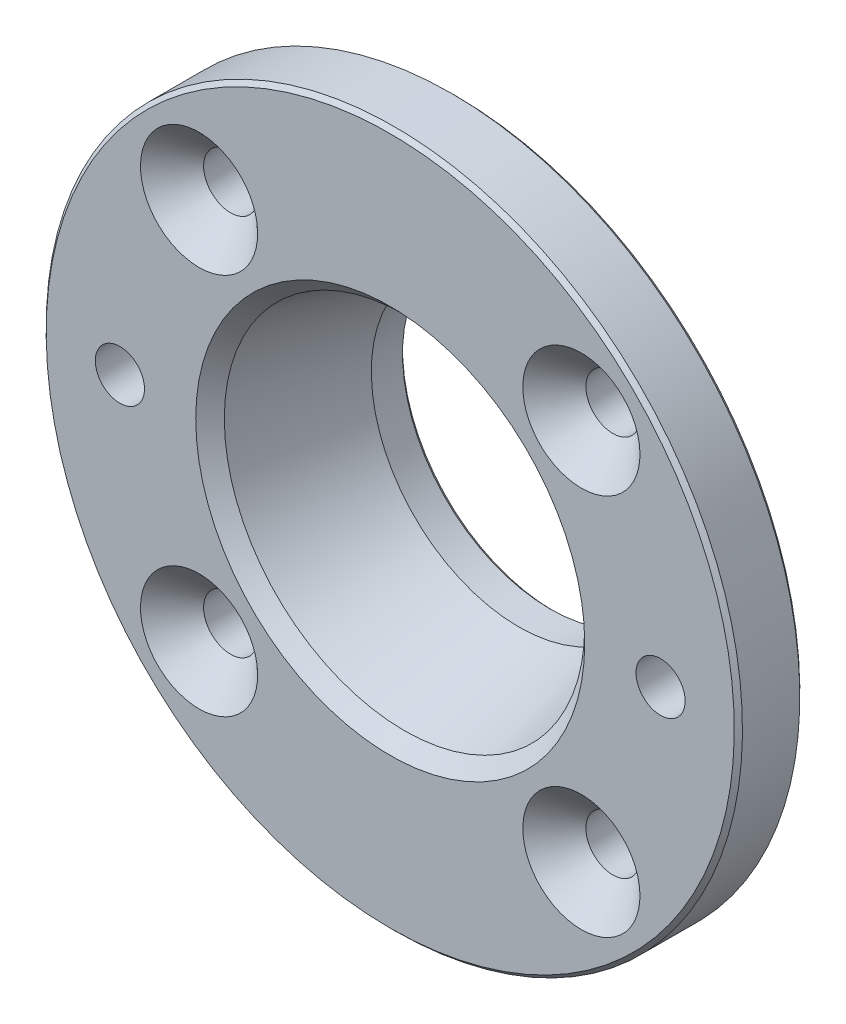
ISO-10303-21;
HEADER;
FILE_DESCRIPTION(('STEP AP214'),'2;1');
FILE_NAME('part.step','',(''),(''),'','','');
FILE_SCHEMA(('AUTOMOTIVE_DESIGN { 1 0 10303 214 1 1 1 1 }'));
ENDSEC;
DATA;
#1=APPLICATION_CONTEXT('core data for automotive mechanical design processes');
#2=APPLICATION_PROTOCOL_DEFINITION('international standard','automotive_design',2000,#1);
#3=PRODUCT_CONTEXT('',#1,'mechanical');
#4=PRODUCT('Part','Part','',(#3));
#5=PRODUCT_RELATED_PRODUCT_CATEGORY('part','',(#4));
#6=PRODUCT_DEFINITION_FORMATION('','',#4);
#7=PRODUCT_DEFINITION_CONTEXT('part definition',#1,'design');
#8=PRODUCT_DEFINITION('design','',#6,#7);
#9=PRODUCT_DEFINITION_SHAPE('','',#8);
#10=(LENGTH_UNIT() NAMED_UNIT(*) SI_UNIT(.MILLI.,.METRE.));
#11=(NAMED_UNIT(*) PLANE_ANGLE_UNIT() SI_UNIT($,.RADIAN.));
#12=(NAMED_UNIT(*) SI_UNIT($,.STERADIAN.) SOLID_ANGLE_UNIT());
#13=UNCERTAINTY_MEASURE_WITH_UNIT(LENGTH_MEASURE(1.E-05),#10,'distance_accuracy_value','');
#14=(GEOMETRIC_REPRESENTATION_CONTEXT(3) GLOBAL_UNCERTAINTY_ASSIGNED_CONTEXT((#13)) GLOBAL_UNIT_ASSIGNED_CONTEXT((#10,
#11,#12)) REPRESENTATION_CONTEXT('',''));
#15=CARTESIAN_POINT('',(0.,0.,0.));
#16=DIRECTION('',(0.,0.,1.));
#17=DIRECTION('',(1.,0.,0.));
#18=AXIS2_PLACEMENT_3D('',#15,#16,#17);
#19=CARTESIAN_POINT('',(0.,0.,-15.693364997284));
#20=DIRECTION('',(0.,0.,1.));
#21=DIRECTION('',(0.,-1.,0.));
#22=AXIS2_PLACEMENT_3D('',#19,#20,#21);
#23=CONICAL_SURFACE('',#22,18.,0.279252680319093);
#24=CARTESIAN_POINT('',(0.,0.,-15.693364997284));
#25=DIRECTION('',(0.,0.,1.));
#26=DIRECTION('',(0.,-1.,0.));
#27=AXIS2_PLACEMENT_3D('',#24,#25,#26);
#28=CIRCLE('',#27,18.);
#29=CARTESIAN_POINT('',(0.,-18.0000000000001,-15.693364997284));
#30=VERTEX_POINT('',#29);
#31=EDGE_CURVE('E58',#30,#30,#28,.T.);
#32=ORIENTED_EDGE('',*,*,#31,.F.);
#33=EDGE_LOOP('',(#32));
#34=FACE_BOUND('',#33,.T.);
#35=CARTESIAN_POINT('',(0.,0.,-1.74370722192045));
#36=DIRECTION('',(0.,0.,-1.));
#37=DIRECTION('',(-1.,0.,0.));
#38=AXIS2_PLACEMENT_3D('',#35,#36,#37);
#39=CIRCLE('',#38,22.);
#40=CARTESIAN_POINT('',(-22.,0.,-1.74370722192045));
#41=VERTEX_POINT('',#40);
#42=EDGE_CURVE('E103',#41,#41,#39,.T.);
#43=ORIENTED_EDGE('',*,*,#42,.F.);
#44=EDGE_LOOP('',(#43));
#45=FACE_BOUND('',#44,.T.);
#46=ADVANCED_FACE('F14',(#34,#45),#23,.F.);
#47=CARTESIAN_POINT('',(0.,0.,0.));
#48=DIRECTION('',(0.,0.,1.));
#49=DIRECTION('',(0.,-1.,0.));
#50=AXIS2_PLACEMENT_3D('',#47,#48,#49);
#51=CYLINDRICAL_SURFACE('',#50,18.);
#52=CARTESIAN_POINT('',(0.,0.,-19.5));
#53=DIRECTION('',(0.,0.,-1.));
#54=DIRECTION('',(0.,1.,0.));
#55=AXIS2_PLACEMENT_3D('',#52,#53,#54);
#56=CIRCLE('',#55,18.);
#57=CARTESIAN_POINT('',(0.,17.9999999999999,-19.5000000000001));
#58=VERTEX_POINT('',#57);
#59=EDGE_CURVE('E34',#58,#58,#56,.T.);
#60=ORIENTED_EDGE('',*,*,#59,.T.);
#61=EDGE_LOOP('',(#60));
#62=FACE_BOUND('',#61,.T.);
#63=ORIENTED_EDGE('',*,*,#31,.T.);
#64=EDGE_LOOP('',(#63));
#65=FACE_BOUND('',#64,.T.);
#66=ADVANCED_FACE('F159',(#62,#65),#51,.F.);
#67=CARTESIAN_POINT('',(18.,0.,-20.));
#68=DIRECTION('',(0.,0.,-1.));
#69=DIRECTION('',(0.,1.,0.));
#70=AXIS2_PLACEMENT_3D('',#67,#68,#69);
#71=PLANE('',#70);
#72=CARTESIAN_POINT('',(0.,0.,-20.));
#73=DIRECTION('',(0.,0.,-1.));
#74=DIRECTION('',(0.,1.,0.));
#75=AXIS2_PLACEMENT_3D('',#72,#73,#74);
#76=CIRCLE('',#75,18.5);
#77=CARTESIAN_POINT('',(0.,18.4999999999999,-20.0000000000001));
#78=VERTEX_POINT('',#77);
#79=EDGE_CURVE('E37',#78,#78,#76,.F.);
#80=ORIENTED_EDGE('',*,*,#79,.T.);
#81=EDGE_LOOP('',(#80));
#82=FACE_BOUND('',#81,.T.);
#83=CARTESIAN_POINT('',(0.,0.,-20.));
#84=DIRECTION('',(0.,0.,-1.));
#85=DIRECTION('',(0.,1.,0.));
#86=AXIS2_PLACEMENT_3D('',#83,#84,#85);
#87=CIRCLE('',#86,24.4);
#88=CARTESIAN_POINT('',(0.,24.3999999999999,-20.0000000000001));
#89=VERTEX_POINT('',#88);
#90=EDGE_CURVE('E40',#89,#89,#87,.T.);
#91=ORIENTED_EDGE('',*,*,#90,.T.);
#92=EDGE_LOOP('',(#91));
#93=FACE_BOUND('',#92,.T.);
#94=ADVANCED_FACE('F165',(#82,#93),#71,.T.);
#95=CARTESIAN_POINT('',(0.,0.,0.));
#96=DIRECTION('',(0.,0.,1.));
#97=DIRECTION('',(0.,-1.,0.));
#98=AXIS2_PLACEMENT_3D('',#95,#96,#97);
#99=CYLINDRICAL_SURFACE('',#98,25.);
#100=CARTESIAN_POINT('',(0.,0.,-10.));
#101=DIRECTION('',(0.,0.,1.));
#102=DIRECTION('',(0.,-1.,0.));
#103=AXIS2_PLACEMENT_3D('',#100,#101,#102);
#104=CIRCLE('',#103,25.);
#105=CARTESIAN_POINT('',(0.,-25.,-9.99999999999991));
#106=VERTEX_POINT('',#105);
#107=EDGE_CURVE('E76',#106,#106,#104,.T.);
#108=ORIENTED_EDGE('',*,*,#107,.F.);
#109=EDGE_LOOP('',(#108));
#110=FACE_BOUND('',#109,.T.);
#111=CARTESIAN_POINT('',(0.,0.,-15.9));
#112=DIRECTION('',(0.,0.,1.));
#113=DIRECTION('',(0.,-1.,0.));
#114=AXIS2_PLACEMENT_3D('',#111,#112,#113);
#115=CIRCLE('',#114,25.);
#116=CARTESIAN_POINT('',(0.,-25.0000000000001,-15.8999999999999));
#117=VERTEX_POINT('',#116);
#118=EDGE_CURVE('E61',#117,#117,#115,.T.);
#119=ORIENTED_EDGE('',*,*,#118,.T.);
#120=EDGE_LOOP('',(#119));
#121=FACE_BOUND('',#120,.T.);
#122=ADVANCED_FACE('F173',(#110,#121),#99,.T.);
#123=CARTESIAN_POINT('',(25.,0.,-8.));
#124=DIRECTION('',(0.,0.,-1.));
#125=DIRECTION('',(0.,1.,0.));
#126=AXIS2_PLACEMENT_3D('',#123,#124,#125);
#127=PLANE('',#126);
#128=CARTESIAN_POINT('',(-33.,0.,-8.));
#129=DIRECTION('',(0.,0.,-1.));
#130=DIRECTION('',(0.,1.,0.));
#131=AXIS2_PLACEMENT_3D('',#128,#129,#130);
#132=CIRCLE('',#131,3.);
#133=CARTESIAN_POINT('',(-33.,3.,-8.00000000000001));
#134=VERTEX_POINT('',#133);
#135=EDGE_CURVE('E109',#134,#134,#132,.T.);
#136=ORIENTED_EDGE('',*,*,#135,.F.);
#137=EDGE_LOOP('',(#136));
#138=FACE_BOUND('',#137,.T.);
#139=CARTESIAN_POINT('',(33.,0.,-8.));
#140=DIRECTION('',(0.,0.,-1.));
#141=DIRECTION('',(0.,1.,0.));
#142=AXIS2_PLACEMENT_3D('',#139,#140,#141);
#143=CIRCLE('',#142,3.);
#144=CARTESIAN_POINT('',(33.,3.,-8.00000000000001));
#145=VERTEX_POINT('',#144);
#146=EDGE_CURVE('E112',#145,#145,#143,.T.);
#147=ORIENTED_EDGE('',*,*,#146,.F.);
#148=EDGE_LOOP('',(#147));
#149=FACE_BOUND('',#148,.T.);
#150=CARTESIAN_POINT('',(-23.3345237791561,23.334523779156,-8.));
#151=DIRECTION('',(0.,0.,-1.));
#152=DIRECTION('',(0.,1.,0.));
#153=AXIS2_PLACEMENT_3D('',#150,#151,#152);
#154=CIRCLE('',#153,3.3);
#155=CARTESIAN_POINT('',(-23.3345237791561,26.634523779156,-8.00000000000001));
#156=VERTEX_POINT('',#155);
#157=EDGE_CURVE('E9',#156,#156,#154,.T.);
#158=ORIENTED_EDGE('',*,*,#157,.F.);
#159=EDGE_LOOP('',(#158));
#160=FACE_BOUND('',#159,.T.);
#161=CARTESIAN_POINT('',(23.334523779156,23.334523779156,-8.));
#162=DIRECTION('',(0.,0.,-1.));
#163=DIRECTION('',(0.,1.,0.));
#164=AXIS2_PLACEMENT_3D('',#161,#162,#163);
#165=CIRCLE('',#164,3.3);
#166=CARTESIAN_POINT('',(23.334523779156,26.634523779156,-8.00000000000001));
#167=VERTEX_POINT('',#166);
#168=EDGE_CURVE('E22',#167,#167,#165,.T.);
#169=ORIENTED_EDGE('',*,*,#168,.F.);
#170=EDGE_LOOP('',(#169));
#171=FACE_BOUND('',#170,.T.);
#172=CARTESIAN_POINT('',(23.3345237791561,-23.3345237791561,-8.));
#173=DIRECTION('',(0.,0.,-1.));
#174=DIRECTION('',(0.,1.,0.));
#175=AXIS2_PLACEMENT_3D('',#172,#173,#174);
#176=CIRCLE('',#175,3.3);
#177=CARTESIAN_POINT('',(23.3345237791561,-20.0345237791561,-8.00000000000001));
#178=VERTEX_POINT('',#177);
#179=EDGE_CURVE('E26',#178,#178,#176,.T.);
#180=ORIENTED_EDGE('',*,*,#179,.F.);
#181=EDGE_LOOP('',(#180));
#182=FACE_BOUND('',#181,.T.);
#183=CARTESIAN_POINT('',(-23.334523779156,-23.3345237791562,-8.));
#184=DIRECTION('',(0.,0.,-1.));
#185=DIRECTION('',(0.,1.,0.));
#186=AXIS2_PLACEMENT_3D('',#183,#184,#185);
#187=CIRCLE('',#186,3.3);
#188=CARTESIAN_POINT('',(-23.334523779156,-20.0345237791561,-8.00000000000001));
#189=VERTEX_POINT('',#188);
#190=EDGE_CURVE('E31',#189,#189,#187,.T.);
#191=ORIENTED_EDGE('',*,*,#190,.F.);
#192=EDGE_LOOP('',(#191));
#193=FACE_BOUND('',#192,.T.);
#194=CARTESIAN_POINT('',(0.,0.,-8.));
#195=DIRECTION('',(0.,0.,1.));
#196=DIRECTION('',(0.,-1.,0.));
#197=AXIS2_PLACEMENT_3D('',#194,#195,#196);
#198=CIRCLE('',#197,26.);
#199=CARTESIAN_POINT('',(0.,-26.,-7.99999999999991));
#200=VERTEX_POINT('',#199);
#201=EDGE_CURVE('E67',#200,#200,#198,.T.);
#202=ORIENTED_EDGE('',*,*,#201,.T.);
#203=EDGE_LOOP('',(#202));
#204=FACE_BOUND('',#203,.T.);
#205=CARTESIAN_POINT('',(0.,0.,-8.));
#206=DIRECTION('',(0.,0.,-1.));
#207=DIRECTION('',(0.,1.,0.));
#208=AXIS2_PLACEMENT_3D('',#205,#206,#207);
#209=CIRCLE('',#208,42.);
#210=CARTESIAN_POINT('',(0.,42.,-8.00000000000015));
#211=VERTEX_POINT('',#210);
#212=EDGE_CURVE('E46',#211,#211,#209,.T.);
#213=ORIENTED_EDGE('',*,*,#212,.T.);
#214=EDGE_LOOP('',(#213));
#215=FACE_BOUND('',#214,.T.);
#216=ADVANCED_FACE('F177',(#138,#149,#160,#171,#182,#193,#204,#215),#127,.T.);
#217=CARTESIAN_POINT('',(0.,0.,0.));
#218=DIRECTION('',(0.,0.,1.));
#219=DIRECTION('',(0.,-1.,0.));
#220=AXIS2_PLACEMENT_3D('',#217,#218,#219);
#221=CYLINDRICAL_SURFACE('',#220,42.5);
#222=CARTESIAN_POINT('',(0.,0.,-0.5));
#223=DIRECTION('',(0.,0.,1.));
#224=DIRECTION('',(0.,-1.,0.));
#225=AXIS2_PLACEMENT_3D('',#222,#223,#224);
#226=CIRCLE('',#225,42.5);
#227=CARTESIAN_POINT('',(0.,-42.5,-0.499999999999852));
#228=VERTEX_POINT('',#227);
#229=EDGE_CURVE('E49',#228,#228,#226,.F.);
#230=ORIENTED_EDGE('',*,*,#229,.T.);
#231=EDGE_LOOP('',(#230));
#232=FACE_BOUND('',#231,.T.);
#233=CARTESIAN_POINT('',(0.,0.,-7.5));
#234=DIRECTION('',(0.,0.,-1.));
#235=DIRECTION('',(0.,1.,0.));
#236=AXIS2_PLACEMENT_3D('',#233,#234,#235);
#237=CIRCLE('',#236,42.5);
#238=CARTESIAN_POINT('',(0.,42.5,-7.50000000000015));
#239=VERTEX_POINT('',#238);
#240=EDGE_CURVE('E52',#239,#239,#237,.F.);
#241=ORIENTED_EDGE('',*,*,#240,.T.);
#242=EDGE_LOOP('',(#241));
#243=FACE_BOUND('',#242,.T.);
#244=ADVANCED_FACE('F128',(#232,#243),#221,.T.);
#245=CARTESIAN_POINT('',(22.5,0.,0.));
#246=DIRECTION('',(0.,0.,1.));
#247=DIRECTION('',(0.,-1.,0.));
#248=AXIS2_PLACEMENT_3D('',#245,#246,#247);
#249=PLANE('',#248);
#250=CARTESIAN_POINT('',(-33.,0.,0.));
#251=DIRECTION('',(0.,0.,1.));
#252=DIRECTION('',(1.,0.,0.));
#253=AXIS2_PLACEMENT_3D('',#250,#251,#252);
#254=CIRCLE('',#253,3.);
#255=CARTESIAN_POINT('',(-30.,0.,0.));
#256=VERTEX_POINT('',#255);
#257=EDGE_CURVE('E115',#256,#256,#254,.T.);
#258=ORIENTED_EDGE('',*,*,#257,.F.);
#259=EDGE_LOOP('',(#258));
#260=FACE_BOUND('',#259,.T.);
#261=CARTESIAN_POINT('',(33.,0.,0.));
#262=DIRECTION('',(0.,0.,1.));
#263=DIRECTION('',(1.,0.,0.));
#264=AXIS2_PLACEMENT_3D('',#261,#262,#263);
#265=CIRCLE('',#264,3.);
#266=CARTESIAN_POINT('',(36.,0.,0.));
#267=VERTEX_POINT('',#266);
#268=EDGE_CURVE('E116',#267,#267,#265,.T.);
#269=ORIENTED_EDGE('',*,*,#268,.F.);
#270=EDGE_LOOP('',(#269));
#271=FACE_BOUND('',#270,.T.);
#272=CARTESIAN_POINT('',(0.,0.,0.));
#273=DIRECTION('',(0.,0.,-1.));
#274=DIRECTION('',(-1.,0.,0.));
#275=AXIS2_PLACEMENT_3D('',#272,#273,#274);
#276=CIRCLE('',#275,23.7437072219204);
#277=CARTESIAN_POINT('',(-23.7437072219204,0.,0.));
#278=VERTEX_POINT('',#277);
#279=EDGE_CURVE('E106',#278,#278,#276,.T.);
#280=ORIENTED_EDGE('',*,*,#279,.T.);
#281=EDGE_LOOP('',(#280));
#282=FACE_BOUND('',#281,.T.);
#283=CARTESIAN_POINT('',(23.334523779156,23.3345237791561,0.));
#284=DIRECTION('',(0.,0.,1.));
#285=DIRECTION('',(0.,-1.,0.));
#286=AXIS2_PLACEMENT_3D('',#283,#284,#285);
#287=CIRCLE('',#286,7.15);
#288=CARTESIAN_POINT('',(23.334523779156,16.1845237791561,0.));
#289=VERTEX_POINT('',#288);
#290=EDGE_CURVE('E100',#289,#289,#287,.T.);
#291=ORIENTED_EDGE('',*,*,#290,.F.);
#292=EDGE_LOOP('',(#291));
#293=FACE_BOUND('',#292,.T.);
#294=CARTESIAN_POINT('',(23.3345237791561,-23.334523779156,0.));
#295=DIRECTION('',(0.,0.,1.));
#296=DIRECTION('',(0.,-1.,0.));
#297=AXIS2_PLACEMENT_3D('',#294,#295,#296);
#298=CIRCLE('',#297,7.15);
#299=CARTESIAN_POINT('',(23.3345237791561,-30.484523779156,1.06436145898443E-13));
#300=VERTEX_POINT('',#299);
#301=EDGE_CURVE('E94',#300,#300,#298,.T.);
#302=ORIENTED_EDGE('',*,*,#301,.F.);
#303=EDGE_LOOP('',(#302));
#304=FACE_BOUND('',#303,.T.);
#305=CARTESIAN_POINT('',(-23.334523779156,-23.3345237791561,0.));
#306=DIRECTION('',(0.,0.,1.));
#307=DIRECTION('',(0.,-1.,0.));
#308=AXIS2_PLACEMENT_3D('',#305,#306,#307);
#309=CIRCLE('',#308,7.15);
#310=CARTESIAN_POINT('',(-23.334523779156,-30.4845237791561,1.06436145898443E-13));
#311=VERTEX_POINT('',#310);
#312=EDGE_CURVE('E88',#311,#311,#309,.T.);
#313=ORIENTED_EDGE('',*,*,#312,.F.);
#314=EDGE_LOOP('',(#313));
#315=FACE_BOUND('',#314,.T.);
#316=CARTESIAN_POINT('',(-23.3345237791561,23.334523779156,0.));
#317=DIRECTION('',(0.,0.,1.));
#318=DIRECTION('',(0.,-1.,0.));
#319=AXIS2_PLACEMENT_3D('',#316,#317,#318);
#320=CIRCLE('',#319,7.15);
#321=CARTESIAN_POINT('',(-23.3345237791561,16.184523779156,0.));
#322=VERTEX_POINT('',#321);
#323=EDGE_CURVE('E82',#322,#322,#320,.T.);
#324=ORIENTED_EDGE('',*,*,#323,.F.);
#325=EDGE_LOOP('',(#324));
#326=FACE_BOUND('',#325,.T.);
#327=CARTESIAN_POINT('',(0.,0.,0.));
#328=DIRECTION('',(0.,0.,1.));
#329=DIRECTION('',(0.,-1.,0.));
#330=AXIS2_PLACEMENT_3D('',#327,#328,#329);
#331=CIRCLE('',#330,42.);
#332=CARTESIAN_POINT('',(0.,-42.,1.46642216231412E-13));
#333=VERTEX_POINT('',#332);
#334=EDGE_CURVE('E55',#333,#333,#331,.T.);
#335=ORIENTED_EDGE('',*,*,#334,.T.);
#336=EDGE_LOOP('',(#335));
#337=FACE_BOUND('',#336,.T.);
#338=ADVANCED_FACE('F124',(#260,#271,#282,#293,#304,#315,#326,#337),#249,.T.);
#339=CARTESIAN_POINT('',(0.,0.,0.));
#340=DIRECTION('',(0.,0.,-1.));
#341=DIRECTION('',(0.,1.,0.));
#342=AXIS2_PLACEMENT_3D('',#339,#340,#341);
#343=CONICAL_SURFACE('',#342,42.,0.785398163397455);
#344=ORIENTED_EDGE('',*,*,#229,.F.);
#345=EDGE_LOOP('',(#344));
#346=FACE_BOUND('',#345,.T.);
#347=ORIENTED_EDGE('',*,*,#334,.F.);
#348=EDGE_LOOP('',(#347));
#349=FACE_BOUND('',#348,.T.);
#350=ADVANCED_FACE('F127',(#346,#349),#343,.T.);
#351=CARTESIAN_POINT('',(0.,0.,-7.5));
#352=DIRECTION('',(0.,0.,1.));
#353=DIRECTION('',(0.,-1.,0.));
#354=AXIS2_PLACEMENT_3D('',#351,#352,#353);
#355=CONICAL_SURFACE('',#354,42.5,0.785398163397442);
#356=ORIENTED_EDGE('',*,*,#212,.F.);
#357=EDGE_LOOP('',(#356));
#358=FACE_BOUND('',#357,.T.);
#359=ORIENTED_EDGE('',*,*,#240,.F.);
#360=EDGE_LOOP('',(#359));
#361=FACE_BOUND('',#360,.T.);
#362=ADVANCED_FACE('F145',(#358,#361),#355,.T.);
#363=CARTESIAN_POINT('',(0.,0.,-16.));
#364=DIRECTION('',(0.,0.,1.));
#365=DIRECTION('',(0.,-1.,0.));
#366=AXIS2_PLACEMENT_3D('',#363,#364,#365);
#367=CONICAL_SURFACE('',#366,24.9,0.785398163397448);
#368=ORIENTED_EDGE('',*,*,#118,.F.);
#369=EDGE_LOOP('',(#368));
#370=FACE_BOUND('',#369,.T.);
#371=CARTESIAN_POINT('',(0.,0.,-16.));
#372=DIRECTION('',(0.,0.,1.));
#373=DIRECTION('',(0.,-1.,0.));
#374=AXIS2_PLACEMENT_3D('',#371,#372,#373);
#375=CIRCLE('',#374,24.9);
#376=CARTESIAN_POINT('',(0.,-24.9000000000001,-15.9999999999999));
#377=VERTEX_POINT('',#376);
#378=EDGE_CURVE('E64',#377,#377,#375,.T.);
#379=ORIENTED_EDGE('',*,*,#378,.T.);
#380=EDGE_LOOP('',(#379));
#381=FACE_BOUND('',#380,.T.);
#382=ADVANCED_FACE('F153',(#370,#381),#367,.T.);
#383=CARTESIAN_POINT('',(0.,0.,0.));
#384=DIRECTION('',(0.,0.,1.));
#385=DIRECTION('',(0.,-1.,0.));
#386=AXIS2_PLACEMENT_3D('',#383,#384,#385);
#387=CYLINDRICAL_SURFACE('',#386,24.9);
#388=CARTESIAN_POINT('',(0.,0.,-19.5));
#389=DIRECTION('',(0.,0.,-1.));
#390=DIRECTION('',(0.,1.,0.));
#391=AXIS2_PLACEMENT_3D('',#388,#389,#390);
#392=CIRCLE('',#391,24.9);
#393=CARTESIAN_POINT('',(0.,24.8999999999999,-19.5000000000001));
#394=VERTEX_POINT('',#393);
#395=EDGE_CURVE('E43',#394,#394,#392,.F.);
#396=ORIENTED_EDGE('',*,*,#395,.T.);
#397=EDGE_LOOP('',(#396));
#398=FACE_BOUND('',#397,.T.);
#399=ORIENTED_EDGE('',*,*,#378,.F.);
#400=EDGE_LOOP('',(#399));
#401=FACE_BOUND('',#400,.T.);
#402=ADVANCED_FACE('F187',(#398,#401),#387,.T.);
#403=CARTESIAN_POINT('',(0.,0.,-19.5));
#404=DIRECTION('',(0.,0.,1.));
#405=DIRECTION('',(0.,-1.,0.));
#406=AXIS2_PLACEMENT_3D('',#403,#404,#405);
#407=CONICAL_SURFACE('',#406,24.9,0.785398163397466);
#408=ORIENTED_EDGE('',*,*,#90,.F.);
#409=EDGE_LOOP('',(#408));
#410=FACE_BOUND('',#409,.T.);
#411=ORIENTED_EDGE('',*,*,#395,.F.);
#412=EDGE_LOOP('',(#411));
#413=FACE_BOUND('',#412,.T.);
#414=ADVANCED_FACE('F191',(#410,#413),#407,.T.);
#415=CARTESIAN_POINT('',(0.,0.,-7.5));
#416=DIRECTION('',(0.,0.,-1.));
#417=DIRECTION('',(0.,1.,0.));
#418=AXIS2_PLACEMENT_3D('',#415,#416,#417);
#419=CONICAL_SURFACE('',#418,25.5,0.785398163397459);
#420=ORIENTED_EDGE('',*,*,#201,.F.);
#421=EDGE_LOOP('',(#420));
#422=FACE_BOUND('',#421,.T.);
#423=CARTESIAN_POINT('',(0.,0.,-7.5));
#424=DIRECTION('',(0.,0.,1.));
#425=DIRECTION('',(0.,-1.,0.));
#426=AXIS2_PLACEMENT_3D('',#423,#424,#425);
#427=CIRCLE('',#426,25.5);
#428=CARTESIAN_POINT('',(0.,-25.5,-7.49999999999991));
#429=VERTEX_POINT('',#428);
#430=EDGE_CURVE('E70',#429,#429,#427,.T.);
#431=ORIENTED_EDGE('',*,*,#430,.T.);
#432=EDGE_LOOP('',(#431));
#433=FACE_BOUND('',#432,.T.);
#434=ADVANCED_FACE('F193',(#422,#433),#419,.F.);
#435=CARTESIAN_POINT('',(24.5,0.,-7.5));
#436=DIRECTION('',(0.,0.,1.));
#437=DIRECTION('',(0.,-1.,0.));
#438=AXIS2_PLACEMENT_3D('',#435,#436,#437);
#439=PLANE('',#438);
#440=CARTESIAN_POINT('',(0.,0.,-7.5));
#441=DIRECTION('',(0.,0.,1.));
#442=DIRECTION('',(0.,-1.,0.));
#443=AXIS2_PLACEMENT_3D('',#440,#441,#442);
#444=CIRCLE('',#443,24.5);
#445=CARTESIAN_POINT('',(0.,-24.5,-7.49999999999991));
#446=VERTEX_POINT('',#445);
#447=EDGE_CURVE('E18',#446,#446,#444,.T.);
#448=ORIENTED_EDGE('',*,*,#447,.T.);
#449=EDGE_LOOP('',(#448));
#450=FACE_BOUND('',#449,.T.);
#451=ORIENTED_EDGE('',*,*,#430,.F.);
#452=EDGE_LOOP('',(#451));
#453=FACE_BOUND('',#452,.T.);
#454=ADVANCED_FACE('F196',(#450,#453),#439,.F.);
#455=CARTESIAN_POINT('',(0.,0.,0.));
#456=DIRECTION('',(0.,0.,1.));
#457=DIRECTION('',(0.,-1.,0.));
#458=AXIS2_PLACEMENT_3D('',#455,#456,#457);
#459=CYLINDRICAL_SURFACE('',#458,24.5);
#460=ORIENTED_EDGE('',*,*,#447,.F.);
#461=EDGE_LOOP('',(#460));
#462=FACE_BOUND('',#461,.T.);
#463=CARTESIAN_POINT('',(0.,0.,-9.5));
#464=DIRECTION('',(0.,0.,1.));
#465=DIRECTION('',(0.,-1.,0.));
#466=AXIS2_PLACEMENT_3D('',#463,#464,#465);
#467=CIRCLE('',#466,24.5);
#468=CARTESIAN_POINT('',(0.,-24.5,-9.49999999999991));
#469=VERTEX_POINT('',#468);
#470=EDGE_CURVE('E73',#469,#469,#467,.T.);
#471=ORIENTED_EDGE('',*,*,#470,.T.);
#472=EDGE_LOOP('',(#471));
#473=FACE_BOUND('',#472,.T.);
#474=ADVANCED_FACE('F200',(#462,#473),#459,.T.);
#475=CARTESIAN_POINT('',(0.,0.,-10.));
#476=DIRECTION('',(0.,0.,-1.));
#477=DIRECTION('',(0.,1.,0.));
#478=AXIS2_PLACEMENT_3D('',#475,#476,#477);
#479=CONICAL_SURFACE('',#478,25.,0.785398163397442);
#480=ORIENTED_EDGE('',*,*,#470,.F.);
#481=EDGE_LOOP('',(#480));
#482=FACE_BOUND('',#481,.T.);
#483=ORIENTED_EDGE('',*,*,#107,.T.);
#484=EDGE_LOOP('',(#483));
#485=FACE_BOUND('',#484,.T.);
#486=ADVANCED_FACE('F204',(#482,#485),#479,.T.);
#487=CARTESIAN_POINT('',(-23.3345237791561,23.334523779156,0.));
#488=DIRECTION('',(0.,0.,1.));
#489=DIRECTION('',(0.,-1.,0.));
#490=AXIS2_PLACEMENT_3D('',#487,#488,#489);
#491=CYLINDRICAL_SURFACE('',#490,3.3);
#492=CARTESIAN_POINT('',(-23.3345237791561,23.334523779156,-3.85000000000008));
#493=DIRECTION('',(0.,0.,1.));
#494=DIRECTION('',(0.,-1.,0.));
#495=AXIS2_PLACEMENT_3D('',#492,#493,#494);
#496=CIRCLE('',#495,3.3);
#497=CARTESIAN_POINT('',(-23.3345237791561,20.034523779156,-3.85000000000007));
#498=VERTEX_POINT('',#497);
#499=EDGE_CURVE('E79',#498,#498,#496,.T.);
#500=ORIENTED_EDGE('',*,*,#499,.T.);
#501=EDGE_LOOP('',(#500));
#502=FACE_BOUND('',#501,.T.);
#503=ORIENTED_EDGE('',*,*,#157,.T.);
#504=EDGE_LOOP('',(#503));
#505=FACE_BOUND('',#504,.T.);
#506=ADVANCED_FACE('F16',(#502,#505),#491,.F.);
#507=CARTESIAN_POINT('',(-23.3345237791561,23.334523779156,0.));
#508=DIRECTION('',(0.,0.,1.));
#509=DIRECTION('',(0.,-1.,0.));
#510=AXIS2_PLACEMENT_3D('',#507,#508,#509);
#511=CONICAL_SURFACE('',#510,7.15,0.785398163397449);
#512=ORIENTED_EDGE('',*,*,#499,.F.);
#513=EDGE_LOOP('',(#512));
#514=FACE_BOUND('',#513,.T.);
#515=ORIENTED_EDGE('',*,*,#323,.T.);
#516=EDGE_LOOP('',(#515));
#517=FACE_BOUND('',#516,.T.);
#518=ADVANCED_FACE('F209',(#514,#517),#511,.F.);
#519=CARTESIAN_POINT('',(-23.334523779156,-23.3345237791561,0.));
#520=DIRECTION('',(0.,0.,1.));
#521=DIRECTION('',(0.,-1.,0.));
#522=AXIS2_PLACEMENT_3D('',#519,#520,#521);
#523=CYLINDRICAL_SURFACE('',#522,3.3);
#524=CARTESIAN_POINT('',(-23.334523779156,-23.3345237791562,-3.84999999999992));
#525=DIRECTION('',(0.,0.,1.));
#526=DIRECTION('',(0.,-1.,0.));
#527=AXIS2_PLACEMENT_3D('',#524,#525,#526);
#528=CIRCLE('',#527,3.3);
#529=CARTESIAN_POINT('',(-23.334523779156,-26.6345237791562,-3.8499999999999));
#530=VERTEX_POINT('',#529);
#531=EDGE_CURVE('E85',#530,#530,#528,.T.);
#532=ORIENTED_EDGE('',*,*,#531,.T.);
#533=EDGE_LOOP('',(#532));
#534=FACE_BOUND('',#533,.T.);
#535=ORIENTED_EDGE('',*,*,#190,.T.);
#536=EDGE_LOOP('',(#535));
#537=FACE_BOUND('',#536,.T.);
#538=ADVANCED_FACE('F212',(#534,#537),#523,.F.);
#539=CARTESIAN_POINT('',(-23.334523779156,-23.3345237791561,0.));
#540=DIRECTION('',(0.,0.,1.));
#541=DIRECTION('',(0.,-1.,0.));
#542=AXIS2_PLACEMENT_3D('',#539,#540,#541);
#543=CONICAL_SURFACE('',#542,7.15,0.785398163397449);
#544=ORIENTED_EDGE('',*,*,#531,.F.);
#545=EDGE_LOOP('',(#544));
#546=FACE_BOUND('',#545,.T.);
#547=ORIENTED_EDGE('',*,*,#312,.T.);
#548=EDGE_LOOP('',(#547));
#549=FACE_BOUND('',#548,.T.);
#550=ADVANCED_FACE('F214',(#546,#549),#543,.F.);
#551=CARTESIAN_POINT('',(23.3345237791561,-23.334523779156,0.));
#552=DIRECTION('',(0.,0.,1.));
#553=DIRECTION('',(0.,-1.,0.));
#554=AXIS2_PLACEMENT_3D('',#551,#552,#553);
#555=CYLINDRICAL_SURFACE('',#554,3.3);
#556=CARTESIAN_POINT('',(23.3345237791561,-23.334523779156,-3.84999999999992));
#557=DIRECTION('',(0.,0.,1.));
#558=DIRECTION('',(0.,-1.,0.));
#559=AXIS2_PLACEMENT_3D('',#556,#557,#558);
#560=CIRCLE('',#559,3.3);
#561=CARTESIAN_POINT('',(23.3345237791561,-26.634523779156,-3.8499999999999));
#562=VERTEX_POINT('',#561);
#563=EDGE_CURVE('E91',#562,#562,#560,.T.);
#564=ORIENTED_EDGE('',*,*,#563,.T.);
#565=EDGE_LOOP('',(#564));
#566=FACE_BOUND('',#565,.T.);
#567=ORIENTED_EDGE('',*,*,#179,.T.);
#568=EDGE_LOOP('',(#567));
#569=FACE_BOUND('',#568,.T.);
#570=ADVANCED_FACE('F217',(#566,#569),#555,.F.);
#571=CARTESIAN_POINT('',(23.3345237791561,-23.334523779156,0.));
#572=DIRECTION('',(0.,0.,1.));
#573=DIRECTION('',(0.,-1.,0.));
#574=AXIS2_PLACEMENT_3D('',#571,#572,#573);
#575=CONICAL_SURFACE('',#574,7.15,0.785398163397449);
#576=ORIENTED_EDGE('',*,*,#563,.F.);
#577=EDGE_LOOP('',(#576));
#578=FACE_BOUND('',#577,.T.);
#579=ORIENTED_EDGE('',*,*,#301,.T.);
#580=EDGE_LOOP('',(#579));
#581=FACE_BOUND('',#580,.T.);
#582=ADVANCED_FACE('F219',(#578,#581),#575,.F.);
#583=CARTESIAN_POINT('',(23.334523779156,23.3345237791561,0.));
#584=DIRECTION('',(0.,0.,1.));
#585=DIRECTION('',(0.,-1.,0.));
#586=AXIS2_PLACEMENT_3D('',#583,#584,#585);
#587=CYLINDRICAL_SURFACE('',#586,3.3);
#588=CARTESIAN_POINT('',(23.334523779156,23.3345237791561,-3.85000000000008));
#589=DIRECTION('',(0.,0.,1.));
#590=DIRECTION('',(0.,-1.,0.));
#591=AXIS2_PLACEMENT_3D('',#588,#589,#590);
#592=CIRCLE('',#591,3.3);
#593=CARTESIAN_POINT('',(23.334523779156,20.0345237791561,-3.85000000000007));
#594=VERTEX_POINT('',#593);
#595=EDGE_CURVE('E97',#594,#594,#592,.T.);
#596=ORIENTED_EDGE('',*,*,#595,.T.);
#597=EDGE_LOOP('',(#596));
#598=FACE_BOUND('',#597,.T.);
#599=ORIENTED_EDGE('',*,*,#168,.T.);
#600=EDGE_LOOP('',(#599));
#601=FACE_BOUND('',#600,.T.);
#602=ADVANCED_FACE('F222',(#598,#601),#587,.F.);
#603=CARTESIAN_POINT('',(23.334523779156,23.3345237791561,0.));
#604=DIRECTION('',(0.,0.,1.));
#605=DIRECTION('',(0.,-1.,0.));
#606=AXIS2_PLACEMENT_3D('',#603,#604,#605);
#607=CONICAL_SURFACE('',#606,7.15,0.785398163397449);
#608=ORIENTED_EDGE('',*,*,#595,.F.);
#609=EDGE_LOOP('',(#608));
#610=FACE_BOUND('',#609,.T.);
#611=ORIENTED_EDGE('',*,*,#290,.T.);
#612=EDGE_LOOP('',(#611));
#613=FACE_BOUND('',#612,.T.);
#614=ADVANCED_FACE('F224',(#610,#613),#607,.F.);
#615=CARTESIAN_POINT('',(0.,0.,-20.));
#616=DIRECTION('',(0.,0.,-1.));
#617=DIRECTION('',(0.,1.,0.));
#618=AXIS2_PLACEMENT_3D('',#615,#616,#617);
#619=CONICAL_SURFACE('',#618,18.5,0.785398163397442);
#620=ORIENTED_EDGE('',*,*,#59,.F.);
#621=EDGE_LOOP('',(#620));
#622=FACE_BOUND('',#621,.T.);
#623=ORIENTED_EDGE('',*,*,#79,.F.);
#624=EDGE_LOOP('',(#623));
#625=FACE_BOUND('',#624,.T.);
#626=ADVANCED_FACE('F227',(#622,#625),#619,.F.);
#627=CARTESIAN_POINT('',(0.,0.,0.));
#628=DIRECTION('',(0.,0.,1.));
#629=DIRECTION('',(1.,0.,0.));
#630=AXIS2_PLACEMENT_3D('',#627,#628,#629);
#631=CONICAL_SURFACE('',#630,23.7437072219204,0.78539816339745);
#632=ORIENTED_EDGE('',*,*,#42,.T.);
#633=EDGE_LOOP('',(#632));
#634=FACE_BOUND('',#633,.T.);
#635=ORIENTED_EDGE('',*,*,#279,.F.);
#636=EDGE_LOOP('',(#635));
#637=FACE_BOUND('',#636,.T.);
#638=ADVANCED_FACE('F229',(#634,#637),#631,.F.);
#639=CARTESIAN_POINT('',(33.,0.,-20.));
#640=DIRECTION('',(0.,0.,1.));
#641=DIRECTION('',(1.,0.,0.));
#642=AXIS2_PLACEMENT_3D('',#639,#640,#641);
#643=CYLINDRICAL_SURFACE('',#642,3.);
#644=ORIENTED_EDGE('',*,*,#146,.T.);
#645=EDGE_LOOP('',(#644));
#646=FACE_BOUND('',#645,.T.);
#647=ORIENTED_EDGE('',*,*,#268,.T.);
#648=EDGE_LOOP('',(#647));
#649=FACE_BOUND('',#648,.T.);
#650=ADVANCED_FACE('F232',(#646,#649),#643,.F.);
#651=CARTESIAN_POINT('',(-33.,0.,-20.));
#652=DIRECTION('',(0.,0.,1.));
#653=DIRECTION('',(1.,0.,0.));
#654=AXIS2_PLACEMENT_3D('',#651,#652,#653);
#655=CYLINDRICAL_SURFACE('',#654,3.);
#656=ORIENTED_EDGE('',*,*,#135,.T.);
#657=EDGE_LOOP('',(#656));
#658=FACE_BOUND('',#657,.T.);
#659=ORIENTED_EDGE('',*,*,#257,.T.);
#660=EDGE_LOOP('',(#659));
#661=FACE_BOUND('',#660,.T.);
#662=ADVANCED_FACE('F122',(#658,#661),#655,.F.);
#663=CLOSED_SHELL('',(#46,#66,#94,#122,#216,#244,#338,#350,#362,#382,#402,#414,#434,#454,#474,
#486,#506,#518,#538,#550,#570,#582,#602,#614,#626,#638,#650,#662));
#664=MANIFOLD_SOLID_BREP('B1',#663);
#665=ADVANCED_BREP_SHAPE_REPRESENTATION('',(#18,#664),#14);
#666=SHAPE_DEFINITION_REPRESENTATION(#9,#665);
ENDSEC;
END-ISO-10303-21;
